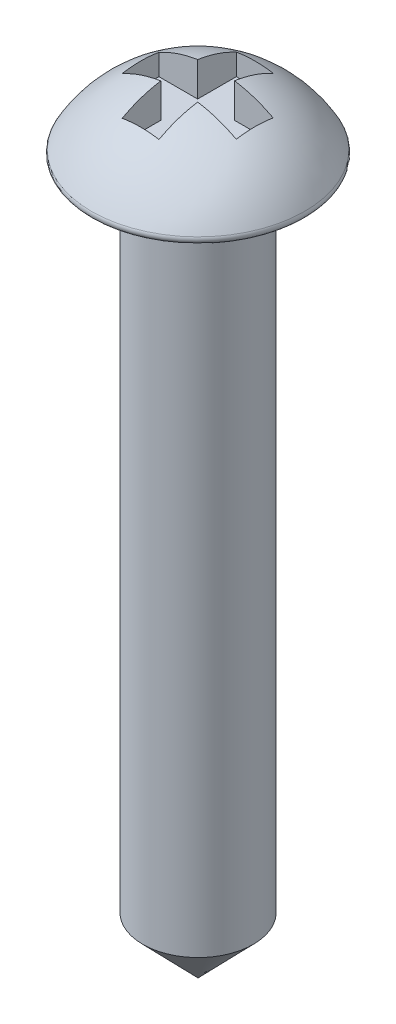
ISO-10303-21;
HEADER;
FILE_DESCRIPTION(('STEP AP214'),'2;1');
FILE_NAME('part.step','',(''),(''),'','','');
FILE_SCHEMA(('AUTOMOTIVE_DESIGN { 1 0 10303 214 1 1 1 1 }'));
ENDSEC;
DATA;
#1=APPLICATION_CONTEXT('core data for automotive mechanical design processes');
#2=APPLICATION_PROTOCOL_DEFINITION('international standard','automotive_design',2000,#1);
#3=PRODUCT_CONTEXT('',#1,'mechanical');
#4=PRODUCT('Part','Part','',(#3));
#5=PRODUCT_RELATED_PRODUCT_CATEGORY('part','',(#4));
#6=PRODUCT_DEFINITION_FORMATION('','',#4);
#7=PRODUCT_DEFINITION_CONTEXT('part definition',#1,'design');
#8=PRODUCT_DEFINITION('design','',#6,#7);
#9=PRODUCT_DEFINITION_SHAPE('','',#8);
#10=(LENGTH_UNIT() NAMED_UNIT(*) SI_UNIT(.MILLI.,.METRE.));
#11=(NAMED_UNIT(*) PLANE_ANGLE_UNIT() SI_UNIT($,.RADIAN.));
#12=(NAMED_UNIT(*) SI_UNIT($,.STERADIAN.) SOLID_ANGLE_UNIT());
#13=UNCERTAINTY_MEASURE_WITH_UNIT(LENGTH_MEASURE(1.E-05),#10,'distance_accuracy_value','');
#14=(GEOMETRIC_REPRESENTATION_CONTEXT(3) GLOBAL_UNCERTAINTY_ASSIGNED_CONTEXT((#13)) GLOBAL_UNIT_ASSIGNED_CONTEXT((#10,
#11,#12)) REPRESENTATION_CONTEXT('',''));
#15=CARTESIAN_POINT('',(0.,0.,0.));
#16=DIRECTION('',(0.,0.,1.));
#17=DIRECTION('',(1.,0.,0.));
#18=AXIS2_PLACEMENT_3D('',#15,#16,#17);
#19=CARTESIAN_POINT('',(0.,-14.1293007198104,0.));
#20=DIRECTION('',(0.,1.,0.));
#21=DIRECTION('',(0.,0.,1.));
#22=AXIS2_PLACEMENT_3D('',#19,#20,#21);
#23=CONICAL_SURFACE('',#22,0.,0.772255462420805);
#24=CARTESIAN_POINT('',(0.,-13.,0.));
#25=DIRECTION('',(0.,1.,0.));
#26=DIRECTION('',(0.,0.,1.));
#27=AXIS2_PLACEMENT_3D('',#24,#25,#26);
#28=CIRCLE('',#27,1.1);
#29=CARTESIAN_POINT('',(0.,-13.,1.1));
#30=VERTEX_POINT('',#29);
#31=EDGE_CURVE('E203',#30,#30,#28,.T.);
#32=ORIENTED_EDGE('',*,*,#31,.F.);
#33=EDGE_LOOP('',(#32));
#34=FACE_BOUND('',#33,.T.);
#35=CARTESIAN_POINT('',(0.,-14.1293007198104,0.));
#36=VERTEX_POINT('',#35);
#37=VERTEX_LOOP('',#36);
#38=FACE_BOUND('',#37,.T.);
#39=ADVANCED_FACE('F35',(#34,#38),#23,.T.);
#40=CARTESIAN_POINT('',(0.,3.8000547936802,0.));
#41=DIRECTION('',(0.,1.,0.));
#42=DIRECTION('',(0.,0.,1.));
#43=AXIS2_PLACEMENT_3D('',#40,#41,#42);
#44=CYLINDRICAL_SURFACE('',#43,1.1);
#45=CARTESIAN_POINT('',(0.,0.,0.));
#46=DIRECTION('',(0.,1.,0.));
#47=DIRECTION('',(0.,0.,1.));
#48=AXIS2_PLACEMENT_3D('',#45,#46,#47);
#49=CIRCLE('',#48,1.1);
#50=CARTESIAN_POINT('',(0.,0.,1.1));
#51=VERTEX_POINT('',#50);
#52=EDGE_CURVE('E172',#51,#51,#49,.T.);
#53=ORIENTED_EDGE('',*,*,#52,.F.);
#54=EDGE_LOOP('',(#53));
#55=FACE_BOUND('',#54,.T.);
#56=ORIENTED_EDGE('',*,*,#31,.T.);
#57=EDGE_LOOP('',(#56));
#58=FACE_BOUND('',#57,.T.);
#59=ADVANCED_FACE('F281',(#55,#58),#44,.T.);
#60=CARTESIAN_POINT('',(2.2,0.,0.));
#61=DIRECTION('',(0.,1.,0.));
#62=DIRECTION('',(0.,0.,1.));
#63=AXIS2_PLACEMENT_3D('',#60,#61,#62);
#64=PLANE('',#63);
#65=CARTESIAN_POINT('',(0.,0.,0.));
#66=DIRECTION('',(0.,1.,0.));
#67=DIRECTION('',(0.,0.,1.));
#68=AXIS2_PLACEMENT_3D('',#65,#66,#67);
#69=CIRCLE('',#68,2.0359463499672);
#70=CARTESIAN_POINT('',(0.,0.,2.0359463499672));
#71=VERTEX_POINT('',#70);
#72=EDGE_CURVE('E209',#71,#71,#69,.F.);
#73=ORIENTED_EDGE('',*,*,#72,.T.);
#74=EDGE_LOOP('',(#73));
#75=FACE_BOUND('',#74,.T.);
#76=ORIENTED_EDGE('',*,*,#52,.T.);
#77=EDGE_LOOP('',(#76));
#78=FACE_BOUND('',#77,.T.);
#79=ADVANCED_FACE('F286',(#75,#78),#64,.F.);
#80=CARTESIAN_POINT('',(0.,-1.04082556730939,0.));
#81=DIRECTION('',(0.,1.,0.));
#82=DIRECTION('',(1.,0.,0.));
#83=AXIS2_PLACEMENT_3D('',#80,#81,#82);
#84=SPHERICAL_SURFACE('',#83,2.43378673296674);
#85=CARTESIAN_POINT('',(0.,-1.04082556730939,0.370388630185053));
#86=DIRECTION('',(0.,0.,1.));
#87=DIRECTION('',(1.,0.,0.));
#88=AXIS2_PLACEMENT_3D('',#85,#86,#87);
#89=CIRCLE('',#88,2.40543761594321);
#90=CARTESIAN_POINT('',(1.13232028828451,1.08143287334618,0.370388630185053));
#91=VERTEX_POINT('',#90);
#92=CARTESIAN_POINT('',(0.361948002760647,1.33722484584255,0.370388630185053));
#93=VERTEX_POINT('',#92);
#94=EDGE_CURVE('E212',#91,#93,#89,.T.);
#95=ORIENTED_EDGE('',*,*,#94,.T.);
#96=CARTESIAN_POINT('',(0.361948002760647,-1.04082556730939,0.));
#97=DIRECTION('',(1.,0.,0.));
#98=DIRECTION('',(0.,0.,-1.));
#99=AXIS2_PLACEMENT_3D('',#96,#97,#98);
#100=CIRCLE('',#99,2.40672214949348);
#101=CARTESIAN_POINT('',(0.361948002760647,1.07836674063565,1.14076091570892));
#102=VERTEX_POINT('',#101);
#103=EDGE_CURVE('E11',#93,#102,#100,.T.);
#104=ORIENTED_EDGE('',*,*,#103,.T.);
#105=CARTESIAN_POINT('',(0.,-1.04082556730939,1.14076091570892));
#106=DIRECTION('',(0.,0.,1.));
#107=DIRECTION('',(1.,0.,0.));
#108=AXIS2_PLACEMENT_3D('',#105,#106,#107);
#109=CIRCLE('',#108,2.14987962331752);
#110=CARTESIAN_POINT('',(-0.371599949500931,1.07669559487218,1.14076091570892));
#111=VERTEX_POINT('',#110);
#112=EDGE_CURVE('E42',#102,#111,#109,.T.);
#113=ORIENTED_EDGE('',*,*,#112,.T.);
#114=CARTESIAN_POINT('',(-0.371599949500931,-1.04082556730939,0.));
#115=DIRECTION('',(-1.,0.,0.));
#116=DIRECTION('',(0.,0.,1.));
#117=AXIS2_PLACEMENT_3D('',#114,#115,#116);
#118=CIRCLE('',#117,2.40525078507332);
#119=CARTESIAN_POINT('',(-0.371599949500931,1.3357357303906,0.370388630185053));
#120=VERTEX_POINT('',#119);
#121=EDGE_CURVE('E238',#111,#120,#118,.T.);
#122=ORIENTED_EDGE('',*,*,#121,.T.);
#123=CARTESIAN_POINT('',(0.,-1.04082556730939,0.370388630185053));
#124=DIRECTION('',(0.,0.,1.));
#125=DIRECTION('',(1.,0.,0.));
#126=AXIS2_PLACEMENT_3D('',#123,#124,#125);
#127=CIRCLE('',#126,2.40543761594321);
#128=CARTESIAN_POINT('',(-1.14197223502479,1.07625486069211,0.370388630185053));
#129=VERTEX_POINT('',#128);
#130=EDGE_CURVE('E235',#120,#129,#127,.T.);
#131=ORIENTED_EDGE('',*,*,#130,.T.);
#132=CARTESIAN_POINT('',(-1.14197223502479,-1.04082556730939,0.));
#133=DIRECTION('',(-1.,0.,0.));
#134=DIRECTION('',(0.,0.,1.));
#135=AXIS2_PLACEMENT_3D('',#132,#133,#134);
#136=CIRCLE('',#135,2.14923644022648);
#137=CARTESIAN_POINT('',(-1.14197223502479,1.07750693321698,-0.363159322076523));
#138=VERTEX_POINT('',#137);
#139=EDGE_CURVE('E232',#129,#138,#136,.T.);
#140=ORIENTED_EDGE('',*,*,#139,.T.);
#141=CARTESIAN_POINT('',(0.,-1.04082556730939,-0.363159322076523));
#142=DIRECTION('',(0.,0.,-1.));
#143=DIRECTION('',(-1.,0.,0.));
#144=AXIS2_PLACEMENT_3D('',#141,#142,#143);
#145=CIRCLE('',#144,2.40653966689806);
#146=CARTESIAN_POINT('',(-0.371599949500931,1.33685116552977,-0.363159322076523));
#147=VERTEX_POINT('',#146);
#148=EDGE_CURVE('E229',#138,#147,#145,.T.);
#149=ORIENTED_EDGE('',*,*,#148,.T.);
#150=CARTESIAN_POINT('',(-0.371599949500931,-1.04082556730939,0.));
#151=DIRECTION('',(-1.,0.,0.));
#152=DIRECTION('',(0.,0.,1.));
#153=AXIS2_PLACEMENT_3D('',#150,#151,#152);
#154=CIRCLE('',#153,2.40525078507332);
#155=CARTESIAN_POINT('',(-0.371599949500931,1.08057430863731,-1.13353160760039));
#156=VERTEX_POINT('',#155);
#157=EDGE_CURVE('E226',#147,#156,#154,.T.);
#158=ORIENTED_EDGE('',*,*,#157,.T.);
#159=CARTESIAN_POINT('',(0.,-1.04082556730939,-1.13353160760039));
#160=DIRECTION('',(0.,0.,-1.));
#161=DIRECTION('',(-1.,0.,0.));
#162=AXIS2_PLACEMENT_3D('',#159,#160,#161);
#163=CIRCLE('',#162,2.15370006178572);
#164=CARTESIAN_POINT('',(0.361948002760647,1.08224240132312,-1.13353160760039));
#165=VERTEX_POINT('',#164);
#166=EDGE_CURVE('E223',#156,#165,#163,.T.);
#167=ORIENTED_EDGE('',*,*,#166,.T.);
#168=CARTESIAN_POINT('',(0.361948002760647,-1.04082556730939,0.));
#169=DIRECTION('',(1.,0.,0.));
#170=DIRECTION('',(0.,0.,-1.));
#171=AXIS2_PLACEMENT_3D('',#168,#169,#170);
#172=CIRCLE('',#171,2.40672214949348);
#173=CARTESIAN_POINT('',(0.361948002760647,1.33833958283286,-0.363159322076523));
#174=VERTEX_POINT('',#173);
#175=EDGE_CURVE('E220',#165,#174,#172,.T.);
#176=ORIENTED_EDGE('',*,*,#175,.T.);
#177=CARTESIAN_POINT('',(0.,-1.04082556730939,-0.363159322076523));
#178=DIRECTION('',(0.,0.,-1.));
#179=DIRECTION('',(-1.,0.,0.));
#180=AXIS2_PLACEMENT_3D('',#177,#178,#179);
#181=CIRCLE('',#180,2.40653966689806);
#182=CARTESIAN_POINT('',(1.13232028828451,1.0826818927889,-0.363159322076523));
#183=VERTEX_POINT('',#182);
#184=EDGE_CURVE('E217',#174,#183,#181,.T.);
#185=ORIENTED_EDGE('',*,*,#184,.T.);
#186=CARTESIAN_POINT('',(1.13232028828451,-1.04082556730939,0.));
#187=DIRECTION('',(1.,0.,0.));
#188=DIRECTION('',(0.,0.,-1.));
#189=AXIS2_PLACEMENT_3D('',#186,#187,#188);
#190=CIRCLE('',#189,2.15433716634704);
#191=EDGE_CURVE('E214',#183,#91,#190,.T.);
#192=ORIENTED_EDGE('',*,*,#191,.T.);
#193=EDGE_LOOP('',(#95,#104,#113,#122,#131,#140,#149,#158,#167,#176,#185,#192));
#194=FACE_BOUND('',#193,.T.);
#195=CARTESIAN_POINT('',(0.,0.14888302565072,0.));
#196=DIRECTION('',(0.,-1.,0.));
#197=DIRECTION('',(0.,0.,-1.));
#198=AXIS2_PLACEMENT_3D('',#195,#196,#197);
#199=CIRCLE('',#198,2.12318424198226);
#200=CARTESIAN_POINT('',(0.,0.14888302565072,-2.12318424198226));
#201=VERTEX_POINT('',#200);
#202=EDGE_CURVE('E206',#201,#201,#199,.F.);
#203=ORIENTED_EDGE('',*,*,#202,.T.);
#204=EDGE_LOOP('',(#203));
#205=FACE_BOUND('',#204,.T.);
#206=ADVANCED_FACE('F242',(#194,#205),#84,.T.);
#207=CARTESIAN_POINT('',(0.,0.100000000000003,0.));
#208=DIRECTION('',(0.,1.,0.));
#209=DIRECTION('',(0.,0.,1.));
#210=AXIS2_PLACEMENT_3D('',#207,#208,#209);
#211=TOROIDAL_SURFACE('',#210,2.0359463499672,0.1);
#212=ORIENTED_EDGE('',*,*,#72,.F.);
#213=EDGE_LOOP('',(#212));
#214=FACE_BOUND('',#213,.T.);
#215=ORIENTED_EDGE('',*,*,#202,.F.);
#216=EDGE_LOOP('',(#215));
#217=FACE_BOUND('',#216,.T.);
#218=ADVANCED_FACE('F299',(#214,#217),#211,.T.);
#219=CARTESIAN_POINT('',(0.361948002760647,0.656537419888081,1.14076091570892));
#220=DIRECTION('',(1.,0.,0.));
#221=DIRECTION('',(0.,0.,-1.));
#222=AXIS2_PLACEMENT_3D('',#219,#220,#221);
#223=PLANE('',#222);
#224=DIRECTION('',(0.,1.,0.));
#225=VECTOR('',#224,1.);
#226=CARTESIAN_POINT('',(0.361948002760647,0.656537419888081,0.370388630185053));
#227=LINE('',#226,#225);
#228=CARTESIAN_POINT('',(0.361948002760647,0.656537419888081,0.370388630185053));
#229=VERTEX_POINT('',#228);
#230=EDGE_CURVE('E49',#229,#93,#227,.T.);
#231=ORIENTED_EDGE('',*,*,#230,.F.);
#232=DIRECTION('',(0.,0.,-1.));
#233=VECTOR('',#232,1.);
#234=CARTESIAN_POINT('',(0.361948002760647,0.656537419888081,1.14076091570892));
#235=LINE('',#234,#233);
#236=CARTESIAN_POINT('',(0.361948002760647,0.656537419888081,1.14076091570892));
#237=VERTEX_POINT('',#236);
#238=EDGE_CURVE('E125',#237,#229,#235,.T.);
#239=ORIENTED_EDGE('',*,*,#238,.F.);
#240=DIRECTION('',(0.,1.,0.));
#241=VECTOR('',#240,1.);
#242=CARTESIAN_POINT('',(0.361948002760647,0.656537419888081,1.14076091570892));
#243=LINE('',#242,#241);
#244=EDGE_CURVE('E170',#237,#102,#243,.T.);
#245=ORIENTED_EDGE('',*,*,#244,.T.);
#246=ORIENTED_EDGE('',*,*,#103,.F.);
#247=EDGE_LOOP('',(#231,#239,#245,#246));
#248=FACE_BOUND('',#247,.T.);
#249=ADVANCED_FACE('F122',(#248),#223,.F.);
#250=CARTESIAN_POINT('',(0.361948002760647,0.656537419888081,1.14076091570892));
#251=DIRECTION('',(0.,0.,1.));
#252=DIRECTION('',(1.,0.,0.));
#253=AXIS2_PLACEMENT_3D('',#250,#251,#252);
#254=PLANE('',#253);
#255=ORIENTED_EDGE('',*,*,#244,.F.);
#256=DIRECTION('',(1.,0.,0.));
#257=VECTOR('',#256,1.);
#258=CARTESIAN_POINT('',(0.361948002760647,0.656537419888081,1.14076091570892));
#259=LINE('',#258,#257);
#260=CARTESIAN_POINT('',(-0.371599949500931,0.656537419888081,1.14076091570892));
#261=VERTEX_POINT('',#260);
#262=EDGE_CURVE('E129',#261,#237,#259,.T.);
#263=ORIENTED_EDGE('',*,*,#262,.F.);
#264=DIRECTION('',(0.,1.,0.));
#265=VECTOR('',#264,1.);
#266=CARTESIAN_POINT('',(-0.371599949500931,0.656537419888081,1.14076091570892));
#267=LINE('',#266,#265);
#268=EDGE_CURVE('E173',#261,#111,#267,.T.);
#269=ORIENTED_EDGE('',*,*,#268,.T.);
#270=ORIENTED_EDGE('',*,*,#112,.F.);
#271=EDGE_LOOP('',(#255,#263,#269,#270));
#272=FACE_BOUND('',#271,.T.);
#273=ADVANCED_FACE('F245',(#272),#254,.F.);
#274=CARTESIAN_POINT('',(-0.371599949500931,0.656537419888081,1.14076091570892));
#275=DIRECTION('',(-1.,0.,0.));
#276=DIRECTION('',(0.,0.,1.));
#277=AXIS2_PLACEMENT_3D('',#274,#275,#276);
#278=PLANE('',#277);
#279=ORIENTED_EDGE('',*,*,#268,.F.);
#280=DIRECTION('',(0.,0.,1.));
#281=VECTOR('',#280,1.);
#282=CARTESIAN_POINT('',(-0.371599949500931,0.656537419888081,1.14076091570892));
#283=LINE('',#282,#281);
#284=CARTESIAN_POINT('',(-0.371599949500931,0.656537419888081,0.370388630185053));
#285=VERTEX_POINT('',#284);
#286=EDGE_CURVE('E167',#285,#261,#283,.T.);
#287=ORIENTED_EDGE('',*,*,#286,.F.);
#288=DIRECTION('',(0.,1.,0.));
#289=VECTOR('',#288,1.);
#290=CARTESIAN_POINT('',(-0.371599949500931,0.656537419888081,0.370388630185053));
#291=LINE('',#290,#289);
#292=EDGE_CURVE('E176',#285,#120,#291,.T.);
#293=ORIENTED_EDGE('',*,*,#292,.T.);
#294=ORIENTED_EDGE('',*,*,#121,.F.);
#295=EDGE_LOOP('',(#279,#287,#293,#294));
#296=FACE_BOUND('',#295,.T.);
#297=ADVANCED_FACE('F248',(#296),#278,.F.);
#298=CARTESIAN_POINT('',(-0.371599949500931,0.656537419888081,0.370388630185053));
#299=DIRECTION('',(0.,0.,1.));
#300=DIRECTION('',(1.,0.,0.));
#301=AXIS2_PLACEMENT_3D('',#298,#299,#300);
#302=PLANE('',#301);
#303=ORIENTED_EDGE('',*,*,#292,.F.);
#304=DIRECTION('',(1.,0.,0.));
#305=VECTOR('',#304,1.);
#306=CARTESIAN_POINT('',(-0.371599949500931,0.656537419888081,0.370388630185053));
#307=LINE('',#306,#305);
#308=CARTESIAN_POINT('',(-1.14197223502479,0.656537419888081,0.370388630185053));
#309=VERTEX_POINT('',#308);
#310=EDGE_CURVE('E164',#309,#285,#307,.T.);
#311=ORIENTED_EDGE('',*,*,#310,.F.);
#312=DIRECTION('',(0.,1.,0.));
#313=VECTOR('',#312,1.);
#314=CARTESIAN_POINT('',(-1.14197223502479,0.656537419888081,0.370388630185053));
#315=LINE('',#314,#313);
#316=EDGE_CURVE('E179',#309,#129,#315,.T.);
#317=ORIENTED_EDGE('',*,*,#316,.T.);
#318=ORIENTED_EDGE('',*,*,#130,.F.);
#319=EDGE_LOOP('',(#303,#311,#317,#318));
#320=FACE_BOUND('',#319,.T.);
#321=ADVANCED_FACE('F252',(#320),#302,.F.);
#322=CARTESIAN_POINT('',(-1.14197223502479,0.656537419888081,0.370388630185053));
#323=DIRECTION('',(-1.,0.,0.));
#324=DIRECTION('',(0.,0.,1.));
#325=AXIS2_PLACEMENT_3D('',#322,#323,#324);
#326=PLANE('',#325);
#327=ORIENTED_EDGE('',*,*,#316,.F.);
#328=DIRECTION('',(0.,0.,1.));
#329=VECTOR('',#328,1.);
#330=CARTESIAN_POINT('',(-1.14197223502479,0.656537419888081,0.370388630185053));
#331=LINE('',#330,#329);
#332=CARTESIAN_POINT('',(-1.14197223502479,0.656537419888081,-0.363159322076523));
#333=VERTEX_POINT('',#332);
#334=EDGE_CURVE('E161',#333,#309,#331,.T.);
#335=ORIENTED_EDGE('',*,*,#334,.F.);
#336=DIRECTION('',(0.,1.,0.));
#337=VECTOR('',#336,1.);
#338=CARTESIAN_POINT('',(-1.14197223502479,0.656537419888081,-0.363159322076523));
#339=LINE('',#338,#337);
#340=EDGE_CURVE('E182',#333,#138,#339,.T.);
#341=ORIENTED_EDGE('',*,*,#340,.T.);
#342=ORIENTED_EDGE('',*,*,#139,.F.);
#343=EDGE_LOOP('',(#327,#335,#341,#342));
#344=FACE_BOUND('',#343,.T.);
#345=ADVANCED_FACE('F254',(#344),#326,.F.);
#346=CARTESIAN_POINT('',(-0.371599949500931,0.656537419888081,-0.363159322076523));
#347=DIRECTION('',(0.,0.,-1.));
#348=DIRECTION('',(-1.,0.,0.));
#349=AXIS2_PLACEMENT_3D('',#346,#347,#348);
#350=PLANE('',#349);
#351=ORIENTED_EDGE('',*,*,#340,.F.);
#352=DIRECTION('',(-1.,0.,0.));
#353=VECTOR('',#352,1.);
#354=CARTESIAN_POINT('',(-0.371599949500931,0.656537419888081,-0.363159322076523));
#355=LINE('',#354,#353);
#356=CARTESIAN_POINT('',(-0.371599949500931,0.656537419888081,-0.363159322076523));
#357=VERTEX_POINT('',#356);
#358=EDGE_CURVE('E158',#357,#333,#355,.T.);
#359=ORIENTED_EDGE('',*,*,#358,.F.);
#360=DIRECTION('',(0.,1.,0.));
#361=VECTOR('',#360,1.);
#362=CARTESIAN_POINT('',(-0.371599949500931,0.656537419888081,-0.363159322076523));
#363=LINE('',#362,#361);
#364=EDGE_CURVE('E185',#357,#147,#363,.T.);
#365=ORIENTED_EDGE('',*,*,#364,.T.);
#366=ORIENTED_EDGE('',*,*,#148,.F.);
#367=EDGE_LOOP('',(#351,#359,#365,#366));
#368=FACE_BOUND('',#367,.T.);
#369=ADVANCED_FACE('F257',(#368),#350,.F.);
#370=CARTESIAN_POINT('',(-0.371599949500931,0.656537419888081,-0.363159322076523));
#371=DIRECTION('',(-1.,0.,0.));
#372=DIRECTION('',(0.,0.,1.));
#373=AXIS2_PLACEMENT_3D('',#370,#371,#372);
#374=PLANE('',#373);
#375=ORIENTED_EDGE('',*,*,#364,.F.);
#376=DIRECTION('',(0.,0.,1.));
#377=VECTOR('',#376,1.);
#378=CARTESIAN_POINT('',(-0.371599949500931,0.656537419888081,-0.363159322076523));
#379=LINE('',#378,#377);
#380=CARTESIAN_POINT('',(-0.371599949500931,0.656537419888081,-1.13353160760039));
#381=VERTEX_POINT('',#380);
#382=EDGE_CURVE('E155',#381,#357,#379,.T.);
#383=ORIENTED_EDGE('',*,*,#382,.F.);
#384=DIRECTION('',(0.,1.,0.));
#385=VECTOR('',#384,1.);
#386=CARTESIAN_POINT('',(-0.371599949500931,0.656537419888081,-1.13353160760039));
#387=LINE('',#386,#385);
#388=EDGE_CURVE('E188',#381,#156,#387,.T.);
#389=ORIENTED_EDGE('',*,*,#388,.T.);
#390=ORIENTED_EDGE('',*,*,#157,.F.);
#391=EDGE_LOOP('',(#375,#383,#389,#390));
#392=FACE_BOUND('',#391,.T.);
#393=ADVANCED_FACE('F260',(#392),#374,.F.);
#394=CARTESIAN_POINT('',(0.361948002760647,0.656537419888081,-1.13353160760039));
#395=DIRECTION('',(0.,0.,-1.));
#396=DIRECTION('',(-1.,0.,0.));
#397=AXIS2_PLACEMENT_3D('',#394,#395,#396);
#398=PLANE('',#397);
#399=ORIENTED_EDGE('',*,*,#388,.F.);
#400=DIRECTION('',(-1.,0.,0.));
#401=VECTOR('',#400,1.);
#402=CARTESIAN_POINT('',(0.361948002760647,0.656537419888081,-1.13353160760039));
#403=LINE('',#402,#401);
#404=CARTESIAN_POINT('',(0.361948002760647,0.656537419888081,-1.13353160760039));
#405=VERTEX_POINT('',#404);
#406=EDGE_CURVE('E152',#405,#381,#403,.T.);
#407=ORIENTED_EDGE('',*,*,#406,.F.);
#408=DIRECTION('',(0.,1.,0.));
#409=VECTOR('',#408,1.);
#410=CARTESIAN_POINT('',(0.361948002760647,0.656537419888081,-1.13353160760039));
#411=LINE('',#410,#409);
#412=EDGE_CURVE('E191',#405,#165,#411,.T.);
#413=ORIENTED_EDGE('',*,*,#412,.T.);
#414=ORIENTED_EDGE('',*,*,#166,.F.);
#415=EDGE_LOOP('',(#399,#407,#413,#414));
#416=FACE_BOUND('',#415,.T.);
#417=ADVANCED_FACE('F262',(#416),#398,.F.);
#418=CARTESIAN_POINT('',(0.361948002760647,0.656537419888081,-0.363159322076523));
#419=DIRECTION('',(1.,0.,0.));
#420=DIRECTION('',(0.,0.,-1.));
#421=AXIS2_PLACEMENT_3D('',#418,#419,#420);
#422=PLANE('',#421);
#423=ORIENTED_EDGE('',*,*,#412,.F.);
#424=DIRECTION('',(0.,0.,-1.));
#425=VECTOR('',#424,1.);
#426=CARTESIAN_POINT('',(0.361948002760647,0.656537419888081,-0.363159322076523));
#427=LINE('',#426,#425);
#428=CARTESIAN_POINT('',(0.361948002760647,0.656537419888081,-0.363159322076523));
#429=VERTEX_POINT('',#428);
#430=EDGE_CURVE('E149',#429,#405,#427,.T.);
#431=ORIENTED_EDGE('',*,*,#430,.F.);
#432=DIRECTION('',(0.,1.,0.));
#433=VECTOR('',#432,1.);
#434=CARTESIAN_POINT('',(0.361948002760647,0.656537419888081,-0.363159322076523));
#435=LINE('',#434,#433);
#436=EDGE_CURVE('E194',#429,#174,#435,.T.);
#437=ORIENTED_EDGE('',*,*,#436,.T.);
#438=ORIENTED_EDGE('',*,*,#175,.F.);
#439=EDGE_LOOP('',(#423,#431,#437,#438));
#440=FACE_BOUND('',#439,.T.);
#441=ADVANCED_FACE('F266',(#440),#422,.F.);
#442=CARTESIAN_POINT('',(1.13232028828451,0.656537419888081,-0.363159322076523));
#443=DIRECTION('',(0.,0.,-1.));
#444=DIRECTION('',(-1.,0.,0.));
#445=AXIS2_PLACEMENT_3D('',#442,#443,#444);
#446=PLANE('',#445);
#447=ORIENTED_EDGE('',*,*,#436,.F.);
#448=DIRECTION('',(-1.,0.,0.));
#449=VECTOR('',#448,1.);
#450=CARTESIAN_POINT('',(1.13232028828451,0.656537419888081,-0.363159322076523));
#451=LINE('',#450,#449);
#452=CARTESIAN_POINT('',(1.13232028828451,0.656537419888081,-0.363159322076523));
#453=VERTEX_POINT('',#452);
#454=EDGE_CURVE('E146',#453,#429,#451,.T.);
#455=ORIENTED_EDGE('',*,*,#454,.F.);
#456=DIRECTION('',(0.,1.,0.));
#457=VECTOR('',#456,1.);
#458=CARTESIAN_POINT('',(1.13232028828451,0.656537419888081,-0.363159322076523));
#459=LINE('',#458,#457);
#460=EDGE_CURVE('E197',#453,#183,#459,.T.);
#461=ORIENTED_EDGE('',*,*,#460,.T.);
#462=ORIENTED_EDGE('',*,*,#184,.F.);
#463=EDGE_LOOP('',(#447,#455,#461,#462));
#464=FACE_BOUND('',#463,.T.);
#465=ADVANCED_FACE('F269',(#464),#446,.F.);
#466=CARTESIAN_POINT('',(1.13232028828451,0.656537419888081,0.370388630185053));
#467=DIRECTION('',(1.,0.,0.));
#468=DIRECTION('',(0.,0.,-1.));
#469=AXIS2_PLACEMENT_3D('',#466,#467,#468);
#470=PLANE('',#469);
#471=ORIENTED_EDGE('',*,*,#460,.F.);
#472=DIRECTION('',(0.,0.,-1.));
#473=VECTOR('',#472,1.);
#474=CARTESIAN_POINT('',(1.13232028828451,0.656537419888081,0.370388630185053));
#475=LINE('',#474,#473);
#476=CARTESIAN_POINT('',(1.13232028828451,0.656537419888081,0.370388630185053));
#477=VERTEX_POINT('',#476);
#478=EDGE_CURVE('E138',#477,#453,#475,.T.);
#479=ORIENTED_EDGE('',*,*,#478,.F.);
#480=DIRECTION('',(0.,1.,0.));
#481=VECTOR('',#480,1.);
#482=CARTESIAN_POINT('',(1.13232028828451,0.656537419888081,0.370388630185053));
#483=LINE('',#482,#481);
#484=EDGE_CURVE('E128',#477,#91,#483,.T.);
#485=ORIENTED_EDGE('',*,*,#484,.T.);
#486=ORIENTED_EDGE('',*,*,#191,.F.);
#487=EDGE_LOOP('',(#471,#479,#485,#486));
#488=FACE_BOUND('',#487,.T.);
#489=ADVANCED_FACE('F271',(#488),#470,.F.);
#490=CARTESIAN_POINT('',(1.13232028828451,0.656537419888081,0.370388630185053));
#491=DIRECTION('',(0.,0.,1.));
#492=DIRECTION('',(1.,0.,0.));
#493=AXIS2_PLACEMENT_3D('',#490,#491,#492);
#494=PLANE('',#493);
#495=ORIENTED_EDGE('',*,*,#484,.F.);
#496=DIRECTION('',(1.,0.,0.));
#497=VECTOR('',#496,1.);
#498=CARTESIAN_POINT('',(1.13232028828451,0.656537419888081,0.370388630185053));
#499=LINE('',#498,#497);
#500=EDGE_CURVE('E132',#229,#477,#499,.T.);
#501=ORIENTED_EDGE('',*,*,#500,.F.);
#502=ORIENTED_EDGE('',*,*,#230,.T.);
#503=ORIENTED_EDGE('',*,*,#94,.F.);
#504=EDGE_LOOP('',(#495,#501,#502,#503));
#505=FACE_BOUND('',#504,.T.);
#506=ADVANCED_FACE('F133',(#505),#494,.F.);
#507=CARTESIAN_POINT('',(0.361948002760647,0.656537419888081,-1.13353160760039));
#508=DIRECTION('',(0.,1.,0.));
#509=DIRECTION('',(0.,0.,1.));
#510=AXIS2_PLACEMENT_3D('',#507,#508,#509);
#511=PLANE('',#510);
#512=ORIENTED_EDGE('',*,*,#238,.T.);
#513=ORIENTED_EDGE('',*,*,#500,.T.);
#514=ORIENTED_EDGE('',*,*,#478,.T.);
#515=ORIENTED_EDGE('',*,*,#454,.T.);
#516=ORIENTED_EDGE('',*,*,#430,.T.);
#517=ORIENTED_EDGE('',*,*,#406,.T.);
#518=ORIENTED_EDGE('',*,*,#382,.T.);
#519=ORIENTED_EDGE('',*,*,#358,.T.);
#520=ORIENTED_EDGE('',*,*,#334,.T.);
#521=ORIENTED_EDGE('',*,*,#310,.T.);
#522=ORIENTED_EDGE('',*,*,#286,.T.);
#523=ORIENTED_EDGE('',*,*,#262,.T.);
#524=EDGE_LOOP('',(#512,#513,#514,#515,#516,#517,#518,#519,#520,#521,#522,#523));
#525=FACE_BOUND('',#524,.T.);
#526=ADVANCED_FACE('F140',(#525),#511,.T.);
#527=CLOSED_SHELL('',(#39,#59,#79,#206,#218,#249,#273,#297,#321,#345,#369,#393,#417,#441,#465,
#489,#506,#526));
#528=MANIFOLD_SOLID_BREP('B2',#527);
#529=ADVANCED_BREP_SHAPE_REPRESENTATION('',(#18,#528),#14);
#530=SHAPE_DEFINITION_REPRESENTATION(#9,#529);
ENDSEC;
END-ISO-10303-21;
